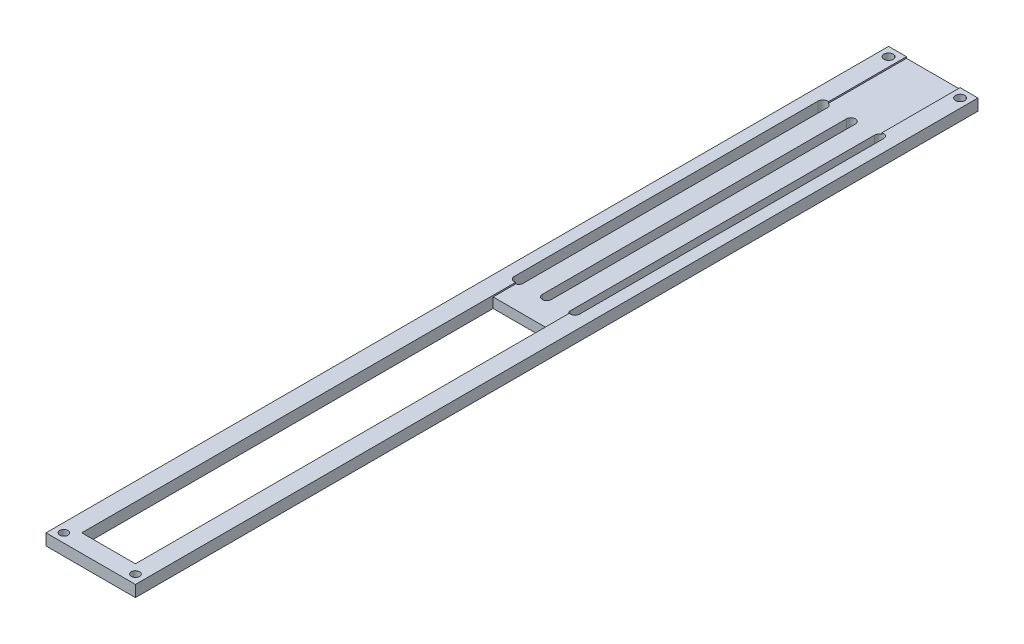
ISO-10303-21;
HEADER;
FILE_DESCRIPTION(('STEP AP214'),'2;1');
FILE_NAME('part.step','',(''),(''),'','','');
FILE_SCHEMA(('AUTOMOTIVE_DESIGN { 1 0 10303 214 1 1 1 1 }'));
ENDSEC;
DATA;
#1=APPLICATION_CONTEXT('core data for automotive mechanical design processes');
#2=APPLICATION_PROTOCOL_DEFINITION('international standard','automotive_design',2000,#1);
#3=PRODUCT_CONTEXT('',#1,'mechanical');
#4=PRODUCT('Part','Part','',(#3));
#5=PRODUCT_RELATED_PRODUCT_CATEGORY('part','',(#4));
#6=PRODUCT_DEFINITION_FORMATION('','',#4);
#7=PRODUCT_DEFINITION_CONTEXT('part definition',#1,'design');
#8=PRODUCT_DEFINITION('design','',#6,#7);
#9=PRODUCT_DEFINITION_SHAPE('','',#8);
#10=(LENGTH_UNIT() NAMED_UNIT(*) SI_UNIT(.MILLI.,.METRE.));
#11=(NAMED_UNIT(*) PLANE_ANGLE_UNIT() SI_UNIT($,.RADIAN.));
#12=(NAMED_UNIT(*) SI_UNIT($,.STERADIAN.) SOLID_ANGLE_UNIT());
#13=UNCERTAINTY_MEASURE_WITH_UNIT(LENGTH_MEASURE(1.E-05),#10,'distance_accuracy_value','');
#14=(GEOMETRIC_REPRESENTATION_CONTEXT(3) GLOBAL_UNCERTAINTY_ASSIGNED_CONTEXT((#13)) GLOBAL_UNIT_ASSIGNED_CONTEXT((#10,
#11,#12)) REPRESENTATION_CONTEXT('',''));
#15=CARTESIAN_POINT('',(0.,0.,0.));
#16=DIRECTION('',(0.,0.,1.));
#17=DIRECTION('',(1.,0.,0.));
#18=AXIS2_PLACEMENT_3D('',#15,#16,#17);
#19=CARTESIAN_POINT('',(15.875,2.032,308.6608));
#20=DIRECTION('',(-1.,0.,0.));
#21=DIRECTION('',(0.,0.,1.));
#22=AXIS2_PLACEMENT_3D('',#19,#20,#21);
#23=PLANE('',#22);
#24=DIRECTION('',(0.,1.,0.));
#25=VECTOR('',#24,1.);
#26=CARTESIAN_POINT('',(15.875,2.032,299.1358));
#27=LINE('',#26,#25);
#28=CARTESIAN_POINT('',(15.875,-2.032,299.1358));
#29=VERTEX_POINT('',#28);
#30=CARTESIAN_POINT('',(15.875,2.032,299.1358));
#31=VERTEX_POINT('',#30);
#32=EDGE_CURVE('E204',#29,#31,#27,.T.);
#33=ORIENTED_EDGE('',*,*,#32,.F.);
#34=DIRECTION('',(0.,0.,-1.));
#35=VECTOR('',#34,1.);
#36=CARTESIAN_POINT('',(15.875,-2.032,308.6608));
#37=LINE('',#36,#35);
#38=CARTESIAN_POINT('',(15.875,-2.032,0.));
#39=VERTEX_POINT('',#38);
#40=EDGE_CURVE('E212',#29,#39,#37,.T.);
#41=ORIENTED_EDGE('',*,*,#40,.T.);
#42=DIRECTION('',(0.,1.,0.));
#43=VECTOR('',#42,1.);
#44=CARTESIAN_POINT('',(15.875,2.032,0.));
#45=LINE('',#44,#43);
#46=CARTESIAN_POINT('',(15.875,2.032,0.));
#47=VERTEX_POINT('',#46);
#48=EDGE_CURVE('E420',#39,#47,#45,.T.);
#49=ORIENTED_EDGE('',*,*,#48,.T.);
#50=DIRECTION('',(0.,0.,-1.));
#51=VECTOR('',#50,1.);
#52=CARTESIAN_POINT('',(15.875,2.032,308.6608));
#53=LINE('',#52,#51);
#54=EDGE_CURVE('E214',#31,#47,#53,.T.);
#55=ORIENTED_EDGE('',*,*,#54,.F.);
#56=EDGE_LOOP('',(#33,#41,#49,#55));
#57=FACE_BOUND('',#56,.T.);
#58=ADVANCED_FACE('F33',(#57),#23,.F.);
#59=CARTESIAN_POINT('',(-15.875,2.032,308.6608));
#60=DIRECTION('',(0.,-1.,0.));
#61=DIRECTION('',(0.,0.,-1.));
#62=AXIS2_PLACEMENT_3D('',#59,#60,#61);
#63=PLANE('',#62);
#64=CARTESIAN_POINT('',(-12.7,2.032,295.9608));
#65=DIRECTION('',(0.,1.,0.));
#66=DIRECTION('',(0.,0.,1.));
#67=AXIS2_PLACEMENT_3D('',#64,#65,#66);
#68=CIRCLE('',#67,1.4732);
#69=CARTESIAN_POINT('',(-12.7,2.032,297.434));
#70=VERTEX_POINT('',#69);
#71=EDGE_CURVE('E248',#70,#70,#68,.T.);
#72=ORIENTED_EDGE('',*,*,#71,.F.);
#73=EDGE_LOOP('',(#72));
#74=FACE_BOUND('',#73,.T.);
#75=CARTESIAN_POINT('',(12.7,2.032,295.9608));
#76=DIRECTION('',(0.,1.,0.));
#77=DIRECTION('',(0.,0.,1.));
#78=AXIS2_PLACEMENT_3D('',#75,#76,#77);
#79=CIRCLE('',#78,1.4732);
#80=CARTESIAN_POINT('',(12.7,2.032,297.434));
#81=VERTEX_POINT('',#80);
#82=EDGE_CURVE('E249',#81,#81,#79,.T.);
#83=ORIENTED_EDGE('',*,*,#82,.F.);
#84=EDGE_LOOP('',(#83));
#85=FACE_BOUND('',#84,.T.);
#86=CARTESIAN_POINT('',(-12.7,2.032,3.175));
#87=DIRECTION('',(0.,1.,0.));
#88=DIRECTION('',(0.,0.,1.));
#89=AXIS2_PLACEMENT_3D('',#86,#87,#88);
#90=CIRCLE('',#89,1.63195);
#91=CARTESIAN_POINT('',(-12.7,2.032,4.80695));
#92=VERTEX_POINT('',#91);
#93=EDGE_CURVE('E279',#92,#92,#90,.T.);
#94=ORIENTED_EDGE('',*,*,#93,.F.);
#95=EDGE_LOOP('',(#94));
#96=FACE_BOUND('',#95,.T.);
#97=CARTESIAN_POINT('',(12.7,2.032,3.175));
#98=DIRECTION('',(0.,1.,0.));
#99=DIRECTION('',(0.,0.,1.));
#100=AXIS2_PLACEMENT_3D('',#97,#98,#99);
#101=CIRCLE('',#100,1.63195);
#102=CARTESIAN_POINT('',(12.7,2.032,4.80695));
#103=VERTEX_POINT('',#102);
#104=EDGE_CURVE('E215',#103,#103,#101,.T.);
#105=ORIENTED_EDGE('',*,*,#104,.F.);
#106=EDGE_LOOP('',(#105));
#107=FACE_BOUND('',#106,.T.);
#108=DIRECTION('',(-1.,0.,0.));
#109=VECTOR('',#108,1.);
#110=CARTESIAN_POINT('',(-15.875,2.032,299.1358));
#111=LINE('',#110,#109);
#112=CARTESIAN_POINT('',(-15.875,2.032,299.1358));
#113=VERTEX_POINT('',#112);
#114=EDGE_CURVE('E216',#31,#113,#111,.T.);
#115=ORIENTED_EDGE('',*,*,#114,.F.);
#116=ORIENTED_EDGE('',*,*,#54,.T.);
#117=DIRECTION('',(-1.,0.,0.));
#118=VECTOR('',#117,1.);
#119=CARTESIAN_POINT('',(-15.875,2.032,0.));
#120=LINE('',#119,#118);
#121=CARTESIAN_POINT('',(9.525,2.032,0.));
#122=VERTEX_POINT('',#121);
#123=EDGE_CURVE('E430',#47,#122,#120,.T.);
#124=ORIENTED_EDGE('',*,*,#123,.T.);
#125=DIRECTION('',(0.,0.,-1.));
#126=VECTOR('',#125,1.);
#127=CARTESIAN_POINT('',(9.525,2.032,146.7358));
#128=LINE('',#127,#126);
#129=CARTESIAN_POINT('',(9.52499999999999,2.032,27.7375137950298));
#130=VERTEX_POINT('',#129);
#131=EDGE_CURVE('E412',#130,#122,#128,.T.);
#132=ORIENTED_EDGE('',*,*,#131,.F.);
#133=CARTESIAN_POINT('',(10.0144886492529,2.032,29.2608));
#134=DIRECTION('',(0.,-1.,0.));
#135=DIRECTION('',(0.,0.,-1.));
#136=AXIS2_PLACEMENT_3D('',#133,#134,#135);
#137=CIRCLE('',#136,1.6);
#138=CARTESIAN_POINT('',(11.6144886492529,2.032,29.2608));
#139=VERTEX_POINT('',#138);
#140=EDGE_CURVE('E312',#130,#139,#137,.T.);
#141=ORIENTED_EDGE('',*,*,#140,.T.);
#142=DIRECTION('',(0.,0.,1.));
#143=VECTOR('',#142,1.);
#144=CARTESIAN_POINT('',(11.6144886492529,2.032,308.6608));
#145=LINE('',#144,#143);
#146=CARTESIAN_POINT('',(11.6144886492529,2.032,137.2108));
#147=VERTEX_POINT('',#146);
#148=EDGE_CURVE('E321',#139,#147,#145,.T.);
#149=ORIENTED_EDGE('',*,*,#148,.T.);
#150=CARTESIAN_POINT('',(10.0144886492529,2.032,137.2108));
#151=DIRECTION('',(0.,-1.,0.));
#152=DIRECTION('',(0.,0.,-1.));
#153=AXIS2_PLACEMENT_3D('',#150,#151,#152);
#154=CIRCLE('',#153,1.6);
#155=CARTESIAN_POINT('',(9.525,2.032,138.73408620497));
#156=VERTEX_POINT('',#155);
#157=EDGE_CURVE('E318',#147,#156,#154,.T.);
#158=ORIENTED_EDGE('',*,*,#157,.T.);
#159=CARTESIAN_POINT('',(9.52500000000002,2.032,292.7858));
#160=VERTEX_POINT('',#159);
#161=EDGE_CURVE('E413',#160,#156,#128,.T.);
#162=ORIENTED_EDGE('',*,*,#161,.F.);
#163=DIRECTION('',(1.,0.,0.));
#164=VECTOR('',#163,1.);
#165=CARTESIAN_POINT('',(-9.52499999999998,2.032,292.7858));
#166=LINE('',#165,#164);
#167=CARTESIAN_POINT('',(-9.52499999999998,2.032,292.7858));
#168=VERTEX_POINT('',#167);
#169=EDGE_CURVE('E409',#168,#160,#166,.T.);
#170=ORIENTED_EDGE('',*,*,#169,.F.);
#171=DIRECTION('',(0.,0.,1.));
#172=VECTOR('',#171,1.);
#173=CARTESIAN_POINT('',(-9.525,2.032,146.7358));
#174=LINE('',#173,#172);
#175=CARTESIAN_POINT('',(-9.525,2.032,138.743095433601));
#176=VERTEX_POINT('',#175);
#177=EDGE_CURVE('E405',#176,#168,#174,.T.);
#178=ORIENTED_EDGE('',*,*,#177,.F.);
#179=CARTESIAN_POINT('',(-9.98551135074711,2.032,137.2108));
#180=DIRECTION('',(0.,-1.,0.));
#181=DIRECTION('',(0.,0.,-1.));
#182=AXIS2_PLACEMENT_3D('',#179,#180,#181);
#183=CIRCLE('',#182,1.6);
#184=CARTESIAN_POINT('',(-11.5855113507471,2.032,137.2108));
#185=VERTEX_POINT('',#184);
#186=EDGE_CURVE('E353',#176,#185,#183,.T.);
#187=ORIENTED_EDGE('',*,*,#186,.T.);
#188=DIRECTION('',(0.,0.,-1.));
#189=VECTOR('',#188,1.);
#190=CARTESIAN_POINT('',(-11.5855113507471,2.032,308.6608));
#191=LINE('',#190,#189);
#192=CARTESIAN_POINT('',(-11.5855113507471,2.032,29.2608));
#193=VERTEX_POINT('',#192);
#194=EDGE_CURVE('E356',#185,#193,#191,.T.);
#195=ORIENTED_EDGE('',*,*,#194,.T.);
#196=CARTESIAN_POINT('',(-9.9855113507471,2.032,29.2608));
#197=DIRECTION('',(0.,-1.,0.));
#198=DIRECTION('',(0.,0.,-1.));
#199=AXIS2_PLACEMENT_3D('',#196,#197,#198);
#200=CIRCLE('',#199,1.6);
#201=CARTESIAN_POINT('',(-9.52500000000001,2.032,27.7285045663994));
#202=VERTEX_POINT('',#201);
#203=EDGE_CURVE('E347',#193,#202,#200,.T.);
#204=ORIENTED_EDGE('',*,*,#203,.T.);
#205=CARTESIAN_POINT('',(-9.525,2.032,0.));
#206=VERTEX_POINT('',#205);
#207=EDGE_CURVE('E406',#206,#202,#174,.T.);
#208=ORIENTED_EDGE('',*,*,#207,.F.);
#209=CARTESIAN_POINT('',(-15.875,2.032,0.));
#210=VERTEX_POINT('',#209);
#211=EDGE_CURVE('E429',#206,#210,#120,.T.);
#212=ORIENTED_EDGE('',*,*,#211,.T.);
#213=DIRECTION('',(0.,0.,-1.));
#214=VECTOR('',#213,1.);
#215=CARTESIAN_POINT('',(-15.875,2.032,308.6608));
#216=LINE('',#215,#214);
#217=EDGE_CURVE('E224',#113,#210,#216,.T.);
#218=ORIENTED_EDGE('',*,*,#217,.F.);
#219=EDGE_LOOP('',(#115,#116,#124,#132,#141,#149,#158,#162,#170,#178,#187,#195,#204,#208,#212,#218));
#220=FACE_BOUND('',#219,.T.);
#221=ADVANCED_FACE('F445',(#74,#85,#96,#107,#220),#63,.F.);
#222=CARTESIAN_POINT('',(-15.875,2.032,308.6608));
#223=DIRECTION('',(1.,0.,0.));
#224=DIRECTION('',(0.,0.,-1.));
#225=AXIS2_PLACEMENT_3D('',#222,#223,#224);
#226=PLANE('',#225);
#227=DIRECTION('',(0.,-1.,0.));
#228=VECTOR('',#227,1.);
#229=CARTESIAN_POINT('',(-15.875,2.032,299.1358));
#230=LINE('',#229,#228);
#231=CARTESIAN_POINT('',(-15.875,-2.032,299.1358));
#232=VERTEX_POINT('',#231);
#233=EDGE_CURVE('E46',#113,#232,#230,.T.);
#234=ORIENTED_EDGE('',*,*,#233,.F.);
#235=ORIENTED_EDGE('',*,*,#217,.T.);
#236=DIRECTION('',(0.,-1.,0.));
#237=VECTOR('',#236,1.);
#238=CARTESIAN_POINT('',(-15.875,2.032,0.));
#239=LINE('',#238,#237);
#240=CARTESIAN_POINT('',(-15.875,-2.032,0.));
#241=VERTEX_POINT('',#240);
#242=EDGE_CURVE('E226',#210,#241,#239,.T.);
#243=ORIENTED_EDGE('',*,*,#242,.T.);
#244=DIRECTION('',(0.,0.,-1.));
#245=VECTOR('',#244,1.);
#246=CARTESIAN_POINT('',(-15.875,-2.032,308.6608));
#247=LINE('',#246,#245);
#248=EDGE_CURVE('E222',#232,#241,#247,.T.);
#249=ORIENTED_EDGE('',*,*,#248,.F.);
#250=EDGE_LOOP('',(#234,#235,#243,#249));
#251=FACE_BOUND('',#250,.T.);
#252=ADVANCED_FACE('F435',(#251),#226,.F.);
#253=CARTESIAN_POINT('',(-15.875,-2.032,308.6608));
#254=DIRECTION('',(0.,1.,0.));
#255=DIRECTION('',(0.,0.,1.));
#256=AXIS2_PLACEMENT_3D('',#253,#254,#255);
#257=PLANE('',#256);
#258=DIRECTION('',(-1.,0.,0.));
#259=VECTOR('',#258,1.);
#260=CARTESIAN_POINT('',(-15.875,-2.032,146.7358));
#261=LINE('',#260,#259);
#262=CARTESIAN_POINT('',(9.525,-2.032,146.7358));
#263=VERTEX_POINT('',#262);
#264=CARTESIAN_POINT('',(-9.525,-2.032,146.7358));
#265=VERTEX_POINT('',#264);
#266=EDGE_CURVE('E238',#263,#265,#261,.T.);
#267=ORIENTED_EDGE('',*,*,#266,.T.);
#268=DIRECTION('',(0.,0.,1.));
#269=VECTOR('',#268,1.);
#270=CARTESIAN_POINT('',(-9.52499999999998,-2.032,308.6608));
#271=LINE('',#270,#269);
#272=CARTESIAN_POINT('',(-9.52499999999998,-2.032,292.7858));
#273=VERTEX_POINT('',#272);
#274=EDGE_CURVE('E241',#265,#273,#271,.T.);
#275=ORIENTED_EDGE('',*,*,#274,.T.);
#276=DIRECTION('',(1.,0.,0.));
#277=VECTOR('',#276,1.);
#278=CARTESIAN_POINT('',(-15.875,-2.032,292.7858));
#279=LINE('',#278,#277);
#280=CARTESIAN_POINT('',(9.52500000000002,-2.032,292.7858));
#281=VERTEX_POINT('',#280);
#282=EDGE_CURVE('E232',#273,#281,#279,.T.);
#283=ORIENTED_EDGE('',*,*,#282,.T.);
#284=DIRECTION('',(0.,0.,-1.));
#285=VECTOR('',#284,1.);
#286=CARTESIAN_POINT('',(9.52500000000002,-2.032,308.6608));
#287=LINE('',#286,#285);
#288=EDGE_CURVE('E235',#281,#263,#287,.T.);
#289=ORIENTED_EDGE('',*,*,#288,.T.);
#290=EDGE_LOOP('',(#267,#275,#283,#289));
#291=FACE_BOUND('',#290,.T.);
#292=CARTESIAN_POINT('',(-12.7,-2.032,295.9608));
#293=DIRECTION('',(0.,1.,0.));
#294=DIRECTION('',(0.,0.,1.));
#295=AXIS2_PLACEMENT_3D('',#292,#293,#294);
#296=CIRCLE('',#295,1.4732);
#297=CARTESIAN_POINT('',(-12.7,-2.032,297.434));
#298=VERTEX_POINT('',#297);
#299=EDGE_CURVE('E383',#298,#298,#296,.T.);
#300=ORIENTED_EDGE('',*,*,#299,.T.);
#301=EDGE_LOOP('',(#300));
#302=FACE_BOUND('',#301,.T.);
#303=CARTESIAN_POINT('',(12.7,-2.032,295.9608));
#304=DIRECTION('',(0.,1.,0.));
#305=DIRECTION('',(0.,0.,1.));
#306=AXIS2_PLACEMENT_3D('',#303,#304,#305);
#307=CIRCLE('',#306,1.4732);
#308=CARTESIAN_POINT('',(12.7,-2.032,297.434));
#309=VERTEX_POINT('',#308);
#310=EDGE_CURVE('E245',#309,#309,#307,.T.);
#311=ORIENTED_EDGE('',*,*,#310,.T.);
#312=EDGE_LOOP('',(#311));
#313=FACE_BOUND('',#312,.T.);
#314=DIRECTION('',(0.,0.,-1.));
#315=VECTOR('',#314,1.);
#316=CARTESIAN_POINT('',(-1.58551135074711,-2.032,137.2108));
#317=LINE('',#316,#315);
#318=CARTESIAN_POINT('',(-1.58551135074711,-2.032,137.2108));
#319=VERTEX_POINT('',#318);
#320=CARTESIAN_POINT('',(-1.5855113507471,-2.032,29.2608));
#321=VERTEX_POINT('',#320);
#322=EDGE_CURVE('E361',#319,#321,#317,.T.);
#323=ORIENTED_EDGE('',*,*,#322,.F.);
#324=CARTESIAN_POINT('',(0.014488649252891,-2.032,137.2108));
#325=DIRECTION('',(0.,-1.,0.));
#326=DIRECTION('',(0.,0.,-1.));
#327=AXIS2_PLACEMENT_3D('',#324,#325,#326);
#328=CIRCLE('',#327,1.6);
#329=CARTESIAN_POINT('',(1.61448864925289,-2.032,137.2108));
#330=VERTEX_POINT('',#329);
#331=EDGE_CURVE('E359',#330,#319,#328,.T.);
#332=ORIENTED_EDGE('',*,*,#331,.F.);
#333=DIRECTION('',(0.,0.,1.));
#334=VECTOR('',#333,1.);
#335=CARTESIAN_POINT('',(1.61448864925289,-2.032,137.2108));
#336=LINE('',#335,#334);
#337=CARTESIAN_POINT('',(1.61448864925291,-2.032,29.2608));
#338=VERTEX_POINT('',#337);
#339=EDGE_CURVE('E367',#338,#330,#336,.T.);
#340=ORIENTED_EDGE('',*,*,#339,.F.);
#341=CARTESIAN_POINT('',(0.0144886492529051,-2.032,29.2608));
#342=DIRECTION('',(0.,-1.,0.));
#343=DIRECTION('',(0.,0.,-1.));
#344=AXIS2_PLACEMENT_3D('',#341,#342,#343);
#345=CIRCLE('',#344,1.6);
#346=EDGE_CURVE('E364',#321,#338,#345,.T.);
#347=ORIENTED_EDGE('',*,*,#346,.F.);
#348=EDGE_LOOP('',(#323,#332,#340,#347));
#349=FACE_BOUND('',#348,.T.);
#350=DIRECTION('',(0.,0.,-1.));
#351=VECTOR('',#350,1.);
#352=CARTESIAN_POINT('',(-11.5855113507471,-2.032,137.2108));
#353=LINE('',#352,#351);
#354=CARTESIAN_POINT('',(-11.5855113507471,-2.032,137.2108));
#355=VERTEX_POINT('',#354);
#356=CARTESIAN_POINT('',(-11.5855113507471,-2.032,29.2608));
#357=VERTEX_POINT('',#356);
#358=EDGE_CURVE('E326',#355,#357,#353,.T.);
#359=ORIENTED_EDGE('',*,*,#358,.F.);
#360=CARTESIAN_POINT('',(-9.98551135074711,-2.032,137.2108));
#361=DIRECTION('',(0.,-1.,0.));
#362=DIRECTION('',(0.,0.,-1.));
#363=AXIS2_PLACEMENT_3D('',#360,#361,#362);
#364=CIRCLE('',#363,1.6);
#365=CARTESIAN_POINT('',(-8.38551135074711,-2.032,137.2108));
#366=VERTEX_POINT('',#365);
#367=EDGE_CURVE('E324',#366,#355,#364,.T.);
#368=ORIENTED_EDGE('',*,*,#367,.F.);
#369=DIRECTION('',(0.,0.,1.));
#370=VECTOR('',#369,1.);
#371=CARTESIAN_POINT('',(-8.38551135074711,-2.032,137.2108));
#372=LINE('',#371,#370);
#373=CARTESIAN_POINT('',(-8.38551135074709,-2.032,29.2608));
#374=VERTEX_POINT('',#373);
#375=EDGE_CURVE('E332',#374,#366,#372,.T.);
#376=ORIENTED_EDGE('',*,*,#375,.F.);
#377=CARTESIAN_POINT('',(-9.9855113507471,-2.032,29.2608));
#378=DIRECTION('',(0.,-1.,0.));
#379=DIRECTION('',(0.,0.,-1.));
#380=AXIS2_PLACEMENT_3D('',#377,#378,#379);
#381=CIRCLE('',#380,1.6);
#382=EDGE_CURVE('E329',#357,#374,#381,.T.);
#383=ORIENTED_EDGE('',*,*,#382,.F.);
#384=EDGE_LOOP('',(#359,#368,#376,#383));
#385=FACE_BOUND('',#384,.T.);
#386=DIRECTION('',(0.,0.,-1.));
#387=VECTOR('',#386,1.);
#388=CARTESIAN_POINT('',(8.41448864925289,-2.032,137.2108));
#389=LINE('',#388,#387);
#390=CARTESIAN_POINT('',(8.41448864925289,-2.032,137.2108));
#391=VERTEX_POINT('',#390);
#392=CARTESIAN_POINT('',(8.41448864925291,-2.032,29.2608));
#393=VERTEX_POINT('',#392);
#394=EDGE_CURVE('E282',#391,#393,#389,.T.);
#395=ORIENTED_EDGE('',*,*,#394,.F.);
#396=CARTESIAN_POINT('',(10.0144886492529,-2.032,137.2108));
#397=DIRECTION('',(0.,-1.,0.));
#398=DIRECTION('',(0.,0.,-1.));
#399=AXIS2_PLACEMENT_3D('',#396,#397,#398);
#400=CIRCLE('',#399,1.6);
#401=CARTESIAN_POINT('',(11.6144886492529,-2.032,137.2108));
#402=VERTEX_POINT('',#401);
#403=EDGE_CURVE('E54',#402,#391,#400,.T.);
#404=ORIENTED_EDGE('',*,*,#403,.F.);
#405=DIRECTION('',(0.,0.,1.));
#406=VECTOR('',#405,1.);
#407=CARTESIAN_POINT('',(11.6144886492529,-2.032,137.2108));
#408=LINE('',#407,#406);
#409=CARTESIAN_POINT('',(11.6144886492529,-2.032,29.2608));
#410=VERTEX_POINT('',#409);
#411=EDGE_CURVE('E298',#410,#402,#408,.T.);
#412=ORIENTED_EDGE('',*,*,#411,.F.);
#413=CARTESIAN_POINT('',(10.0144886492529,-2.032,29.2608));
#414=DIRECTION('',(0.,-1.,0.));
#415=DIRECTION('',(0.,0.,-1.));
#416=AXIS2_PLACEMENT_3D('',#413,#414,#415);
#417=CIRCLE('',#416,1.6);
#418=EDGE_CURVE('E295',#393,#410,#417,.T.);
#419=ORIENTED_EDGE('',*,*,#418,.F.);
#420=EDGE_LOOP('',(#395,#404,#412,#419));
#421=FACE_BOUND('',#420,.T.);
#422=CARTESIAN_POINT('',(-12.7,-2.032,3.175));
#423=DIRECTION('',(0.,1.,0.));
#424=DIRECTION('',(0.,0.,1.));
#425=AXIS2_PLACEMENT_3D('',#422,#423,#424);
#426=CIRCLE('',#425,1.63194999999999);
#427=CARTESIAN_POINT('',(-12.7,-2.032,4.80695));
#428=VERTEX_POINT('',#427);
#429=EDGE_CURVE('E277',#428,#428,#426,.T.);
#430=ORIENTED_EDGE('',*,*,#429,.T.);
#431=EDGE_LOOP('',(#430));
#432=FACE_BOUND('',#431,.T.);
#433=CARTESIAN_POINT('',(12.7,-2.032,3.175));
#434=DIRECTION('',(0.,1.,0.));
#435=DIRECTION('',(0.,0.,1.));
#436=AXIS2_PLACEMENT_3D('',#433,#434,#435);
#437=CIRCLE('',#436,1.63194999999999);
#438=CARTESIAN_POINT('',(12.7,-2.032,4.80695));
#439=VERTEX_POINT('',#438);
#440=EDGE_CURVE('E285',#439,#439,#437,.T.);
#441=ORIENTED_EDGE('',*,*,#440,.T.);
#442=EDGE_LOOP('',(#441));
#443=FACE_BOUND('',#442,.T.);
#444=DIRECTION('',(1.,0.,0.));
#445=VECTOR('',#444,1.);
#446=CARTESIAN_POINT('',(-15.875,-2.032,299.1358));
#447=LINE('',#446,#445);
#448=EDGE_CURVE('E11',#232,#29,#447,.T.);
#449=ORIENTED_EDGE('',*,*,#448,.F.);
#450=ORIENTED_EDGE('',*,*,#248,.T.);
#451=DIRECTION('',(1.,0.,0.));
#452=VECTOR('',#451,1.);
#453=CARTESIAN_POINT('',(-15.875,-2.032,0.));
#454=LINE('',#453,#452);
#455=EDGE_CURVE('E220',#241,#39,#454,.T.);
#456=ORIENTED_EDGE('',*,*,#455,.T.);
#457=ORIENTED_EDGE('',*,*,#40,.F.);
#458=EDGE_LOOP('',(#449,#450,#456,#457));
#459=FACE_BOUND('',#458,.T.);
#460=ADVANCED_FACE('F218',(#291,#302,#313,#349,#385,#421,#432,#443,#459),#257,.F.);
#461=CARTESIAN_POINT('',(9.525,-4.318,146.7358));
#462=DIRECTION('',(1.,0.,0.));
#463=DIRECTION('',(0.,0.,-1.));
#464=AXIS2_PLACEMENT_3D('',#461,#462,#463);
#465=PLANE('',#464);
#466=ORIENTED_EDGE('',*,*,#161,.T.);
#467=DIRECTION('',(0.,-1.,0.));
#468=VECTOR('',#467,1.);
#469=CARTESIAN_POINT('',(9.525,6.096,138.73408620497));
#470=LINE('',#469,#468);
#471=CARTESIAN_POINT('',(9.525,1.524,138.73408620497));
#472=VERTEX_POINT('',#471);
#473=EDGE_CURVE('E315',#156,#472,#470,.T.);
#474=ORIENTED_EDGE('',*,*,#473,.T.);
#475=DIRECTION('',(0.,0.,-1.));
#476=VECTOR('',#475,1.);
#477=CARTESIAN_POINT('',(9.525,1.524,146.7358));
#478=LINE('',#477,#476);
#479=CARTESIAN_POINT('',(9.525,1.524,146.7358));
#480=VERTEX_POINT('',#479);
#481=EDGE_CURVE('E393',#480,#472,#478,.T.);
#482=ORIENTED_EDGE('',*,*,#481,.F.);
#483=DIRECTION('',(0.,1.,0.));
#484=VECTOR('',#483,1.);
#485=CARTESIAN_POINT('',(9.525,-4.318,146.7358));
#486=LINE('',#485,#484);
#487=EDGE_CURVE('E421',#263,#480,#486,.T.);
#488=ORIENTED_EDGE('',*,*,#487,.F.);
#489=ORIENTED_EDGE('',*,*,#288,.F.);
#490=DIRECTION('',(0.,1.,0.));
#491=VECTOR('',#490,1.);
#492=CARTESIAN_POINT('',(9.52500000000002,-4.318,292.7858));
#493=LINE('',#492,#491);
#494=EDGE_CURVE('E424',#281,#160,#493,.T.);
#495=ORIENTED_EDGE('',*,*,#494,.T.);
#496=EDGE_LOOP('',(#466,#474,#482,#488,#489,#495));
#497=FACE_BOUND('',#496,.T.);
#498=ADVANCED_FACE('F466',(#497),#465,.F.);
#499=CARTESIAN_POINT('',(-9.525,-4.318,146.7358));
#500=DIRECTION('',(-1.,0.,0.));
#501=DIRECTION('',(0.,0.,1.));
#502=AXIS2_PLACEMENT_3D('',#499,#500,#501);
#503=PLANE('',#502);
#504=DIRECTION('',(0.,0.,1.));
#505=VECTOR('',#504,1.);
#506=CARTESIAN_POINT('',(-9.525,1.524,146.7358));
#507=LINE('',#506,#505);
#508=CARTESIAN_POINT('',(-9.525,1.524,138.743095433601));
#509=VERTEX_POINT('',#508);
#510=CARTESIAN_POINT('',(-9.525,1.524,146.7358));
#511=VERTEX_POINT('',#510);
#512=EDGE_CURVE('E386',#509,#511,#507,.T.);
#513=ORIENTED_EDGE('',*,*,#512,.F.);
#514=DIRECTION('',(0.,-1.,0.));
#515=VECTOR('',#514,1.);
#516=CARTESIAN_POINT('',(-9.525,6.096,138.743095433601));
#517=LINE('',#516,#515);
#518=EDGE_CURVE('E350',#509,#176,#517,.F.);
#519=ORIENTED_EDGE('',*,*,#518,.T.);
#520=ORIENTED_EDGE('',*,*,#177,.T.);
#521=DIRECTION('',(0.,1.,0.));
#522=VECTOR('',#521,1.);
#523=CARTESIAN_POINT('',(-9.52499999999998,-4.318,292.7858));
#524=LINE('',#523,#522);
#525=EDGE_CURVE('E416',#273,#168,#524,.T.);
#526=ORIENTED_EDGE('',*,*,#525,.F.);
#527=ORIENTED_EDGE('',*,*,#274,.F.);
#528=DIRECTION('',(0.,1.,0.));
#529=VECTOR('',#528,1.);
#530=CARTESIAN_POINT('',(-9.525,-4.318,146.7358));
#531=LINE('',#530,#529);
#532=EDGE_CURVE('E417',#265,#511,#531,.T.);
#533=ORIENTED_EDGE('',*,*,#532,.T.);
#534=EDGE_LOOP('',(#513,#519,#520,#526,#527,#533));
#535=FACE_BOUND('',#534,.T.);
#536=ADVANCED_FACE('F471',(#535),#503,.F.);
#537=CARTESIAN_POINT('',(0.,0.,0.));
#538=DIRECTION('',(0.,0.,1.));
#539=DIRECTION('',(1.,0.,0.));
#540=AXIS2_PLACEMENT_3D('',#537,#538,#539);
#541=PLANE('',#540);
#542=ORIENTED_EDGE('',*,*,#211,.F.);
#543=DIRECTION('',(0.,-1.,0.));
#544=VECTOR('',#543,1.);
#545=CARTESIAN_POINT('',(-9.525,0.,0.));
#546=LINE('',#545,#544);
#547=CARTESIAN_POINT('',(-9.525,1.524,0.));
#548=VERTEX_POINT('',#547);
#549=EDGE_CURVE('E402',#206,#548,#546,.T.);
#550=ORIENTED_EDGE('',*,*,#549,.T.);
#551=DIRECTION('',(1.,0.,0.));
#552=VECTOR('',#551,1.);
#553=CARTESIAN_POINT('',(0.,1.524,0.));
#554=LINE('',#553,#552);
#555=CARTESIAN_POINT('',(9.525,1.524,0.));
#556=VERTEX_POINT('',#555);
#557=EDGE_CURVE('E396',#548,#556,#554,.T.);
#558=ORIENTED_EDGE('',*,*,#557,.T.);
#559=DIRECTION('',(0.,1.,0.));
#560=VECTOR('',#559,1.);
#561=CARTESIAN_POINT('',(9.525,0.,0.));
#562=LINE('',#561,#560);
#563=EDGE_CURVE('E399',#556,#122,#562,.T.);
#564=ORIENTED_EDGE('',*,*,#563,.T.);
#565=ORIENTED_EDGE('',*,*,#123,.F.);
#566=ORIENTED_EDGE('',*,*,#48,.F.);
#567=ORIENTED_EDGE('',*,*,#455,.F.);
#568=ORIENTED_EDGE('',*,*,#242,.F.);
#569=EDGE_LOOP('',(#542,#550,#558,#564,#565,#566,#567,#568));
#570=FACE_BOUND('',#569,.T.);
#571=ADVANCED_FACE('F440',(#570),#541,.F.);
#572=ORIENTED_EDGE('',*,*,#207,.T.);
#573=DIRECTION('',(0.,-1.,0.));
#574=VECTOR('',#573,1.);
#575=CARTESIAN_POINT('',(-9.52500000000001,6.096,27.7285045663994));
#576=LINE('',#575,#574);
#577=CARTESIAN_POINT('',(-9.525,1.524,27.7285045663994));
#578=VERTEX_POINT('',#577);
#579=EDGE_CURVE('E338',#202,#578,#576,.T.);
#580=ORIENTED_EDGE('',*,*,#579,.T.);
#581=EDGE_CURVE('E387',#548,#578,#507,.T.);
#582=ORIENTED_EDGE('',*,*,#581,.F.);
#583=ORIENTED_EDGE('',*,*,#549,.F.);
#584=EDGE_LOOP('',(#572,#580,#582,#583));
#585=FACE_BOUND('',#584,.T.);
#586=ADVANCED_FACE('F470',(#585),#503,.F.);
#587=CARTESIAN_POINT('',(-9.525,-4.318,146.7358));
#588=DIRECTION('',(0.,0.,-1.));
#589=DIRECTION('',(-1.,0.,0.));
#590=AXIS2_PLACEMENT_3D('',#587,#588,#589);
#591=PLANE('',#590);
#592=ORIENTED_EDGE('',*,*,#487,.T.);
#593=DIRECTION('',(1.,0.,0.));
#594=VECTOR('',#593,1.);
#595=CARTESIAN_POINT('',(-9.525,1.524,146.7358));
#596=LINE('',#595,#594);
#597=EDGE_CURVE('E390',#511,#480,#596,.T.);
#598=ORIENTED_EDGE('',*,*,#597,.F.);
#599=ORIENTED_EDGE('',*,*,#532,.F.);
#600=ORIENTED_EDGE('',*,*,#266,.F.);
#601=EDGE_LOOP('',(#592,#598,#599,#600));
#602=FACE_BOUND('',#601,.T.);
#603=ADVANCED_FACE('F474',(#602),#591,.F.);
#604=CARTESIAN_POINT('',(9.525,1.524,27.7375137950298));
#605=VERTEX_POINT('',#604);
#606=EDGE_CURVE('E392',#605,#556,#478,.T.);
#607=ORIENTED_EDGE('',*,*,#606,.F.);
#608=DIRECTION('',(0.,-1.,0.));
#609=VECTOR('',#608,1.);
#610=CARTESIAN_POINT('',(9.52499999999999,6.096,27.7375137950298));
#611=LINE('',#610,#609);
#612=EDGE_CURVE('E304',#605,#130,#611,.F.);
#613=ORIENTED_EDGE('',*,*,#612,.T.);
#614=ORIENTED_EDGE('',*,*,#131,.T.);
#615=ORIENTED_EDGE('',*,*,#563,.F.);
#616=EDGE_LOOP('',(#607,#613,#614,#615));
#617=FACE_BOUND('',#616,.T.);
#618=ADVANCED_FACE('F480',(#617),#465,.F.);
#619=CARTESIAN_POINT('',(-9.52499999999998,-4.318,292.7858));
#620=DIRECTION('',(0.,0.,1.));
#621=DIRECTION('',(1.,0.,0.));
#622=AXIS2_PLACEMENT_3D('',#619,#620,#621);
#623=PLANE('',#622);
#624=ORIENTED_EDGE('',*,*,#525,.T.);
#625=ORIENTED_EDGE('',*,*,#169,.T.);
#626=ORIENTED_EDGE('',*,*,#494,.F.);
#627=ORIENTED_EDGE('',*,*,#282,.F.);
#628=EDGE_LOOP('',(#624,#625,#626,#627));
#629=FACE_BOUND('',#628,.T.);
#630=ADVANCED_FACE('F476',(#629),#623,.F.);
#631=CARTESIAN_POINT('',(0.,1.524,0.));
#632=DIRECTION('',(0.,-1.,0.));
#633=DIRECTION('',(0.,0.,-1.));
#634=AXIS2_PLACEMENT_3D('',#631,#632,#633);
#635=PLANE('',#634);
#636=ORIENTED_EDGE('',*,*,#481,.T.);
#637=CARTESIAN_POINT('',(10.0144886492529,1.524,137.2108));
#638=DIRECTION('',(0.,-1.,0.));
#639=DIRECTION('',(0.,0.,-1.));
#640=AXIS2_PLACEMENT_3D('',#637,#638,#639);
#641=CIRCLE('',#640,1.6);
#642=CARTESIAN_POINT('',(8.41448864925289,1.524,137.2108));
#643=VERTEX_POINT('',#642);
#644=EDGE_CURVE('E40',#472,#643,#641,.T.);
#645=ORIENTED_EDGE('',*,*,#644,.T.);
#646=DIRECTION('',(0.,0.,-1.));
#647=VECTOR('',#646,1.);
#648=CARTESIAN_POINT('',(8.41448864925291,1.524,0.));
#649=LINE('',#648,#647);
#650=CARTESIAN_POINT('',(8.41448864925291,1.524,29.2608));
#651=VERTEX_POINT('',#650);
#652=EDGE_CURVE('E270',#643,#651,#649,.T.);
#653=ORIENTED_EDGE('',*,*,#652,.T.);
#654=CARTESIAN_POINT('',(10.0144886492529,1.524,29.2608));
#655=DIRECTION('',(0.,-1.,0.));
#656=DIRECTION('',(0.,0.,-1.));
#657=AXIS2_PLACEMENT_3D('',#654,#655,#656);
#658=CIRCLE('',#657,1.6);
#659=EDGE_CURVE('E273',#651,#605,#658,.T.);
#660=ORIENTED_EDGE('',*,*,#659,.T.);
#661=ORIENTED_EDGE('',*,*,#606,.T.);
#662=ORIENTED_EDGE('',*,*,#557,.F.);
#663=ORIENTED_EDGE('',*,*,#581,.T.);
#664=CARTESIAN_POINT('',(-9.9855113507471,1.524,29.2608));
#665=DIRECTION('',(0.,-1.,0.));
#666=DIRECTION('',(0.,0.,-1.));
#667=AXIS2_PLACEMENT_3D('',#664,#665,#666);
#668=CIRCLE('',#667,1.6);
#669=CARTESIAN_POINT('',(-8.38551135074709,1.524,29.2608));
#670=VERTEX_POINT('',#669);
#671=EDGE_CURVE('E261',#578,#670,#668,.T.);
#672=ORIENTED_EDGE('',*,*,#671,.T.);
#673=DIRECTION('',(0.,0.,1.));
#674=VECTOR('',#673,1.);
#675=CARTESIAN_POINT('',(-8.38551135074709,1.524,0.));
#676=LINE('',#675,#674);
#677=CARTESIAN_POINT('',(-8.38551135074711,1.524,137.2108));
#678=VERTEX_POINT('',#677);
#679=EDGE_CURVE('E264',#670,#678,#676,.T.);
#680=ORIENTED_EDGE('',*,*,#679,.T.);
#681=CARTESIAN_POINT('',(-9.98551135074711,1.524,137.2108));
#682=DIRECTION('',(0.,-1.,0.));
#683=DIRECTION('',(0.,0.,-1.));
#684=AXIS2_PLACEMENT_3D('',#681,#682,#683);
#685=CIRCLE('',#684,1.6);
#686=EDGE_CURVE('E267',#678,#509,#685,.T.);
#687=ORIENTED_EDGE('',*,*,#686,.T.);
#688=ORIENTED_EDGE('',*,*,#512,.T.);
#689=ORIENTED_EDGE('',*,*,#597,.T.);
#690=EDGE_LOOP('',(#636,#645,#653,#660,#661,#662,#663,#672,#680,#687,#688,#689));
#691=FACE_BOUND('',#690,.T.);
#692=DIRECTION('',(0.,0.,1.));
#693=VECTOR('',#692,1.);
#694=CARTESIAN_POINT('',(1.61448864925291,1.524,0.));
#695=LINE('',#694,#693);
#696=CARTESIAN_POINT('',(1.61448864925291,1.524,29.2608));
#697=VERTEX_POINT('',#696);
#698=CARTESIAN_POINT('',(1.61448864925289,1.524,137.2108));
#699=VERTEX_POINT('',#698);
#700=EDGE_CURVE('E255',#697,#699,#695,.T.);
#701=ORIENTED_EDGE('',*,*,#700,.T.);
#702=CARTESIAN_POINT('',(0.014488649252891,1.524,137.2108));
#703=DIRECTION('',(0.,-1.,0.));
#704=DIRECTION('',(0.,0.,-1.));
#705=AXIS2_PLACEMENT_3D('',#702,#703,#704);
#706=CIRCLE('',#705,1.6);
#707=CARTESIAN_POINT('',(-1.58551135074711,1.524,137.2108));
#708=VERTEX_POINT('',#707);
#709=EDGE_CURVE('E258',#699,#708,#706,.T.);
#710=ORIENTED_EDGE('',*,*,#709,.T.);
#711=DIRECTION('',(0.,0.,-1.));
#712=VECTOR('',#711,1.);
#713=CARTESIAN_POINT('',(-1.58551135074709,1.524,0.));
#714=LINE('',#713,#712);
#715=CARTESIAN_POINT('',(-1.5855113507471,1.524,29.2608));
#716=VERTEX_POINT('',#715);
#717=EDGE_CURVE('E244',#708,#716,#714,.T.);
#718=ORIENTED_EDGE('',*,*,#717,.T.);
#719=CARTESIAN_POINT('',(0.0144886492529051,1.524,29.2608));
#720=DIRECTION('',(0.,-1.,0.));
#721=DIRECTION('',(0.,0.,-1.));
#722=AXIS2_PLACEMENT_3D('',#719,#720,#721);
#723=CIRCLE('',#722,1.6);
#724=EDGE_CURVE('E252',#716,#697,#723,.T.);
#725=ORIENTED_EDGE('',*,*,#724,.T.);
#726=EDGE_LOOP('',(#701,#710,#718,#725));
#727=FACE_BOUND('',#726,.T.);
#728=ADVANCED_FACE('F479',(#691,#727),#635,.F.);
#729=CARTESIAN_POINT('',(-12.7,2.032,295.9608));
#730=DIRECTION('',(0.,1.,0.));
#731=DIRECTION('',(0.,0.,1.));
#732=AXIS2_PLACEMENT_3D('',#729,#730,#731);
#733=CYLINDRICAL_SURFACE('',#732,1.4732);
#734=ORIENTED_EDGE('',*,*,#71,.T.);
#735=EDGE_LOOP('',(#734));
#736=FACE_BOUND('',#735,.T.);
#737=ORIENTED_EDGE('',*,*,#299,.F.);
#738=EDGE_LOOP('',(#737));
#739=FACE_BOUND('',#738,.T.);
#740=ADVANCED_FACE('F490',(#736,#739),#733,.F.);
#741=CARTESIAN_POINT('',(12.7,2.032,295.9608));
#742=DIRECTION('',(0.,1.,0.));
#743=DIRECTION('',(0.,0.,1.));
#744=AXIS2_PLACEMENT_3D('',#741,#742,#743);
#745=CYLINDRICAL_SURFACE('',#744,1.4732);
#746=ORIENTED_EDGE('',*,*,#82,.T.);
#747=EDGE_LOOP('',(#746));
#748=FACE_BOUND('',#747,.T.);
#749=ORIENTED_EDGE('',*,*,#310,.F.);
#750=EDGE_LOOP('',(#749));
#751=FACE_BOUND('',#750,.T.);
#752=ADVANCED_FACE('F494',(#748,#751),#745,.F.);
#753=CARTESIAN_POINT('',(0.014488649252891,6.096,137.2108));
#754=DIRECTION('',(0.,-1.,0.));
#755=DIRECTION('',(0.,0.,-1.));
#756=AXIS2_PLACEMENT_3D('',#753,#754,#755);
#757=CYLINDRICAL_SURFACE('',#756,1.6);
#758=DIRECTION('',(0.,-1.,0.));
#759=VECTOR('',#758,1.);
#760=CARTESIAN_POINT('',(1.61448864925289,6.096,137.2108));
#761=LINE('',#760,#759);
#762=EDGE_CURVE('E371',#699,#330,#761,.T.);
#763=ORIENTED_EDGE('',*,*,#762,.T.);
#764=ORIENTED_EDGE('',*,*,#331,.T.);
#765=DIRECTION('',(0.,-1.,0.));
#766=VECTOR('',#765,1.);
#767=CARTESIAN_POINT('',(-1.58551135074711,6.096,137.2108));
#768=LINE('',#767,#766);
#769=EDGE_CURVE('E370',#708,#319,#768,.T.);
#770=ORIENTED_EDGE('',*,*,#769,.F.);
#771=ORIENTED_EDGE('',*,*,#709,.F.);
#772=EDGE_LOOP('',(#763,#764,#770,#771));
#773=FACE_BOUND('',#772,.T.);
#774=ADVANCED_FACE('F498',(#773),#757,.F.);
#775=CARTESIAN_POINT('',(1.61448864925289,6.096,137.2108));
#776=DIRECTION('',(1.,0.,0.));
#777=DIRECTION('',(0.,0.,-1.));
#778=AXIS2_PLACEMENT_3D('',#775,#776,#777);
#779=PLANE('',#778);
#780=DIRECTION('',(0.,-1.,0.));
#781=VECTOR('',#780,1.);
#782=CARTESIAN_POINT('',(1.61448864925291,6.096,29.2608));
#783=LINE('',#782,#781);
#784=EDGE_CURVE('E373',#697,#338,#783,.T.);
#785=ORIENTED_EDGE('',*,*,#784,.T.);
#786=ORIENTED_EDGE('',*,*,#339,.T.);
#787=ORIENTED_EDGE('',*,*,#762,.F.);
#788=ORIENTED_EDGE('',*,*,#700,.F.);
#789=EDGE_LOOP('',(#785,#786,#787,#788));
#790=FACE_BOUND('',#789,.T.);
#791=ADVANCED_FACE('F502',(#790),#779,.F.);
#792=CARTESIAN_POINT('',(0.0144886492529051,6.096,29.2608));
#793=DIRECTION('',(0.,-1.,0.));
#794=DIRECTION('',(0.,0.,-1.));
#795=AXIS2_PLACEMENT_3D('',#792,#793,#794);
#796=CYLINDRICAL_SURFACE('',#795,1.6);
#797=DIRECTION('',(0.,-1.,0.));
#798=VECTOR('',#797,1.);
#799=CARTESIAN_POINT('',(-1.5855113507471,6.096,29.2608));
#800=LINE('',#799,#798);
#801=EDGE_CURVE('E375',#716,#321,#800,.T.);
#802=ORIENTED_EDGE('',*,*,#801,.T.);
#803=ORIENTED_EDGE('',*,*,#346,.T.);
#804=ORIENTED_EDGE('',*,*,#784,.F.);
#805=ORIENTED_EDGE('',*,*,#724,.F.);
#806=EDGE_LOOP('',(#802,#803,#804,#805));
#807=FACE_BOUND('',#806,.T.);
#808=ADVANCED_FACE('F508',(#807),#796,.F.);
#809=CARTESIAN_POINT('',(-1.58551135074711,6.096,137.2108));
#810=DIRECTION('',(-1.,0.,0.));
#811=DIRECTION('',(0.,0.,1.));
#812=AXIS2_PLACEMENT_3D('',#809,#810,#811);
#813=PLANE('',#812);
#814=ORIENTED_EDGE('',*,*,#769,.T.);
#815=ORIENTED_EDGE('',*,*,#322,.T.);
#816=ORIENTED_EDGE('',*,*,#801,.F.);
#817=ORIENTED_EDGE('',*,*,#717,.F.);
#818=EDGE_LOOP('',(#814,#815,#816,#817));
#819=FACE_BOUND('',#818,.T.);
#820=ADVANCED_FACE('F504',(#819),#813,.F.);
#821=CARTESIAN_POINT('',(-11.5855113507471,6.096,137.2108));
#822=DIRECTION('',(-1.,0.,0.));
#823=DIRECTION('',(0.,0.,1.));
#824=AXIS2_PLACEMENT_3D('',#821,#822,#823);
#825=PLANE('',#824);
#826=DIRECTION('',(0.,-1.,0.));
#827=VECTOR('',#826,1.);
#828=CARTESIAN_POINT('',(-11.5855113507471,6.096,137.2108));
#829=LINE('',#828,#827);
#830=EDGE_CURVE('E335',#185,#355,#829,.T.);
#831=ORIENTED_EDGE('',*,*,#830,.T.);
#832=ORIENTED_EDGE('',*,*,#358,.T.);
#833=DIRECTION('',(0.,-1.,0.));
#834=VECTOR('',#833,1.);
#835=CARTESIAN_POINT('',(-11.5855113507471,6.096,29.2608));
#836=LINE('',#835,#834);
#837=EDGE_CURVE('E341',#193,#357,#836,.T.);
#838=ORIENTED_EDGE('',*,*,#837,.F.);
#839=ORIENTED_EDGE('',*,*,#194,.F.);
#840=EDGE_LOOP('',(#831,#832,#838,#839));
#841=FACE_BOUND('',#840,.T.);
#842=ADVANCED_FACE('F507',(#841),#825,.F.);
#843=CARTESIAN_POINT('',(-9.98551135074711,6.096,137.2108));
#844=DIRECTION('',(0.,-1.,0.));
#845=DIRECTION('',(0.,0.,-1.));
#846=AXIS2_PLACEMENT_3D('',#843,#844,#845);
#847=CYLINDRICAL_SURFACE('',#846,1.6);
#848=ORIENTED_EDGE('',*,*,#518,.F.);
#849=ORIENTED_EDGE('',*,*,#686,.F.);
#850=DIRECTION('',(0.,-1.,0.));
#851=VECTOR('',#850,1.);
#852=CARTESIAN_POINT('',(-8.38551135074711,6.096,137.2108));
#853=LINE('',#852,#851);
#854=EDGE_CURVE('E336',#678,#366,#853,.T.);
#855=ORIENTED_EDGE('',*,*,#854,.T.);
#856=ORIENTED_EDGE('',*,*,#367,.T.);
#857=ORIENTED_EDGE('',*,*,#830,.F.);
#858=ORIENTED_EDGE('',*,*,#186,.F.);
#859=EDGE_LOOP('',(#848,#849,#855,#856,#857,#858));
#860=FACE_BOUND('',#859,.T.);
#861=ADVANCED_FACE('F516',(#860),#847,.F.);
#862=CARTESIAN_POINT('',(-8.38551135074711,6.096,137.2108));
#863=DIRECTION('',(1.,0.,0.));
#864=DIRECTION('',(0.,0.,-1.));
#865=AXIS2_PLACEMENT_3D('',#862,#863,#864);
#866=PLANE('',#865);
#867=DIRECTION('',(0.,-1.,0.));
#868=VECTOR('',#867,1.);
#869=CARTESIAN_POINT('',(-8.38551135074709,6.096,29.2608));
#870=LINE('',#869,#868);
#871=EDGE_CURVE('E339',#670,#374,#870,.T.);
#872=ORIENTED_EDGE('',*,*,#871,.T.);
#873=ORIENTED_EDGE('',*,*,#375,.T.);
#874=ORIENTED_EDGE('',*,*,#854,.F.);
#875=ORIENTED_EDGE('',*,*,#679,.F.);
#876=EDGE_LOOP('',(#872,#873,#874,#875));
#877=FACE_BOUND('',#876,.T.);
#878=ADVANCED_FACE('F519',(#877),#866,.F.);
#879=CARTESIAN_POINT('',(-9.9855113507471,6.096,29.2608));
#880=DIRECTION('',(0.,-1.,0.));
#881=DIRECTION('',(0.,0.,-1.));
#882=AXIS2_PLACEMENT_3D('',#879,#880,#881);
#883=CYLINDRICAL_SURFACE('',#882,1.6);
#884=ORIENTED_EDGE('',*,*,#837,.T.);
#885=ORIENTED_EDGE('',*,*,#382,.T.);
#886=ORIENTED_EDGE('',*,*,#871,.F.);
#887=ORIENTED_EDGE('',*,*,#671,.F.);
#888=ORIENTED_EDGE('',*,*,#579,.F.);
#889=ORIENTED_EDGE('',*,*,#203,.F.);
#890=EDGE_LOOP('',(#884,#885,#886,#887,#888,#889));
#891=FACE_BOUND('',#890,.T.);
#892=ADVANCED_FACE('F524',(#891),#883,.F.);
#893=CARTESIAN_POINT('',(11.6144886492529,6.096,137.2108));
#894=DIRECTION('',(1.,0.,0.));
#895=DIRECTION('',(0.,0.,-1.));
#896=AXIS2_PLACEMENT_3D('',#893,#894,#895);
#897=PLANE('',#896);
#898=DIRECTION('',(0.,-1.,0.));
#899=VECTOR('',#898,1.);
#900=CARTESIAN_POINT('',(11.6144886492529,6.096,29.2608));
#901=LINE('',#900,#899);
#902=EDGE_CURVE('E305',#139,#410,#901,.T.);
#903=ORIENTED_EDGE('',*,*,#902,.T.);
#904=ORIENTED_EDGE('',*,*,#411,.T.);
#905=DIRECTION('',(0.,-1.,0.));
#906=VECTOR('',#905,1.);
#907=CARTESIAN_POINT('',(11.6144886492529,6.096,137.2108));
#908=LINE('',#907,#906);
#909=EDGE_CURVE('E302',#147,#402,#908,.T.);
#910=ORIENTED_EDGE('',*,*,#909,.F.);
#911=ORIENTED_EDGE('',*,*,#148,.F.);
#912=EDGE_LOOP('',(#903,#904,#910,#911));
#913=FACE_BOUND('',#912,.T.);
#914=ADVANCED_FACE('F527',(#913),#897,.F.);
#915=CARTESIAN_POINT('',(10.0144886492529,6.096,137.2108));
#916=DIRECTION('',(0.,-1.,0.));
#917=DIRECTION('',(0.,0.,-1.));
#918=AXIS2_PLACEMENT_3D('',#915,#916,#917);
#919=CYLINDRICAL_SURFACE('',#918,1.6);
#920=ORIENTED_EDGE('',*,*,#909,.T.);
#921=ORIENTED_EDGE('',*,*,#403,.T.);
#922=DIRECTION('',(0.,-1.,0.));
#923=VECTOR('',#922,1.);
#924=CARTESIAN_POINT('',(8.41448864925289,6.096,137.2108));
#925=LINE('',#924,#923);
#926=EDGE_CURVE('E301',#643,#391,#925,.T.);
#927=ORIENTED_EDGE('',*,*,#926,.F.);
#928=ORIENTED_EDGE('',*,*,#644,.F.);
#929=ORIENTED_EDGE('',*,*,#473,.F.);
#930=ORIENTED_EDGE('',*,*,#157,.F.);
#931=EDGE_LOOP('',(#920,#921,#927,#928,#929,#930));
#932=FACE_BOUND('',#931,.T.);
#933=ADVANCED_FACE('F532',(#932),#919,.F.);
#934=CARTESIAN_POINT('',(10.0144886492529,6.096,29.2608));
#935=DIRECTION('',(0.,-1.,0.));
#936=DIRECTION('',(0.,0.,-1.));
#937=AXIS2_PLACEMENT_3D('',#934,#935,#936);
#938=CYLINDRICAL_SURFACE('',#937,1.6);
#939=ORIENTED_EDGE('',*,*,#612,.F.);
#940=ORIENTED_EDGE('',*,*,#659,.F.);
#941=DIRECTION('',(0.,-1.,0.));
#942=VECTOR('',#941,1.);
#943=CARTESIAN_POINT('',(8.41448864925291,6.096,29.2608));
#944=LINE('',#943,#942);
#945=EDGE_CURVE('E307',#651,#393,#944,.T.);
#946=ORIENTED_EDGE('',*,*,#945,.T.);
#947=ORIENTED_EDGE('',*,*,#418,.T.);
#948=ORIENTED_EDGE('',*,*,#902,.F.);
#949=ORIENTED_EDGE('',*,*,#140,.F.);
#950=EDGE_LOOP('',(#939,#940,#946,#947,#948,#949));
#951=FACE_BOUND('',#950,.T.);
#952=ADVANCED_FACE('F535',(#951),#938,.F.);
#953=CARTESIAN_POINT('',(8.41448864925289,6.096,137.2108));
#954=DIRECTION('',(-1.,0.,0.));
#955=DIRECTION('',(0.,0.,1.));
#956=AXIS2_PLACEMENT_3D('',#953,#954,#955);
#957=PLANE('',#956);
#958=ORIENTED_EDGE('',*,*,#926,.T.);
#959=ORIENTED_EDGE('',*,*,#394,.T.);
#960=ORIENTED_EDGE('',*,*,#945,.F.);
#961=ORIENTED_EDGE('',*,*,#652,.F.);
#962=EDGE_LOOP('',(#958,#959,#960,#961));
#963=FACE_BOUND('',#962,.T.);
#964=ADVANCED_FACE('F536',(#963),#957,.F.);
#965=CARTESIAN_POINT('',(-12.7,2.032,3.175));
#966=DIRECTION('',(0.,1.,0.));
#967=DIRECTION('',(0.,0.,1.));
#968=AXIS2_PLACEMENT_3D('',#965,#966,#967);
#969=CYLINDRICAL_SURFACE('',#968,1.63194999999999);
#970=ORIENTED_EDGE('',*,*,#93,.T.);
#971=EDGE_LOOP('',(#970));
#972=FACE_BOUND('',#971,.T.);
#973=ORIENTED_EDGE('',*,*,#429,.F.);
#974=EDGE_LOOP('',(#973));
#975=FACE_BOUND('',#974,.T.);
#976=ADVANCED_FACE('F539',(#972,#975),#969,.F.);
#977=CARTESIAN_POINT('',(12.7,2.032,3.175));
#978=DIRECTION('',(0.,1.,0.));
#979=DIRECTION('',(0.,0.,1.));
#980=AXIS2_PLACEMENT_3D('',#977,#978,#979);
#981=CYLINDRICAL_SURFACE('',#980,1.63194999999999);
#982=ORIENTED_EDGE('',*,*,#104,.T.);
#983=EDGE_LOOP('',(#982));
#984=FACE_BOUND('',#983,.T.);
#985=ORIENTED_EDGE('',*,*,#440,.F.);
#986=EDGE_LOOP('',(#985));
#987=FACE_BOUND('',#986,.T.);
#988=ADVANCED_FACE('F451',(#984,#987),#981,.F.);
#989=CARTESIAN_POINT('',(0.,0.,299.1358));
#990=DIRECTION('',(0.,0.,1.));
#991=DIRECTION('',(1.,0.,0.));
#992=AXIS2_PLACEMENT_3D('',#989,#990,#991);
#993=PLANE('',#992);
#994=ORIENTED_EDGE('',*,*,#32,.T.);
#995=ORIENTED_EDGE('',*,*,#114,.T.);
#996=ORIENTED_EDGE('',*,*,#233,.T.);
#997=ORIENTED_EDGE('',*,*,#448,.T.);
#998=EDGE_LOOP('',(#994,#995,#996,#997));
#999=FACE_BOUND('',#998,.T.);
#1000=ADVANCED_FACE('F203',(#999),#993,.T.);
#1001=CLOSED_SHELL('',(#58,#221,#252,#460,#498,#536,#571,#586,#603,#618,#630,#728,#740,#752,
#774,#791,#808,#820,#842,#861,#878,#892,#914,#933,#952,#964,#976,#988,#1000));
#1002=MANIFOLD_SOLID_BREP('B2',#1001);
#1003=ADVANCED_BREP_SHAPE_REPRESENTATION('',(#18,#1002),#14);
#1004=SHAPE_DEFINITION_REPRESENTATION(#9,#1003);
ENDSEC;
END-ISO-10303-21;
